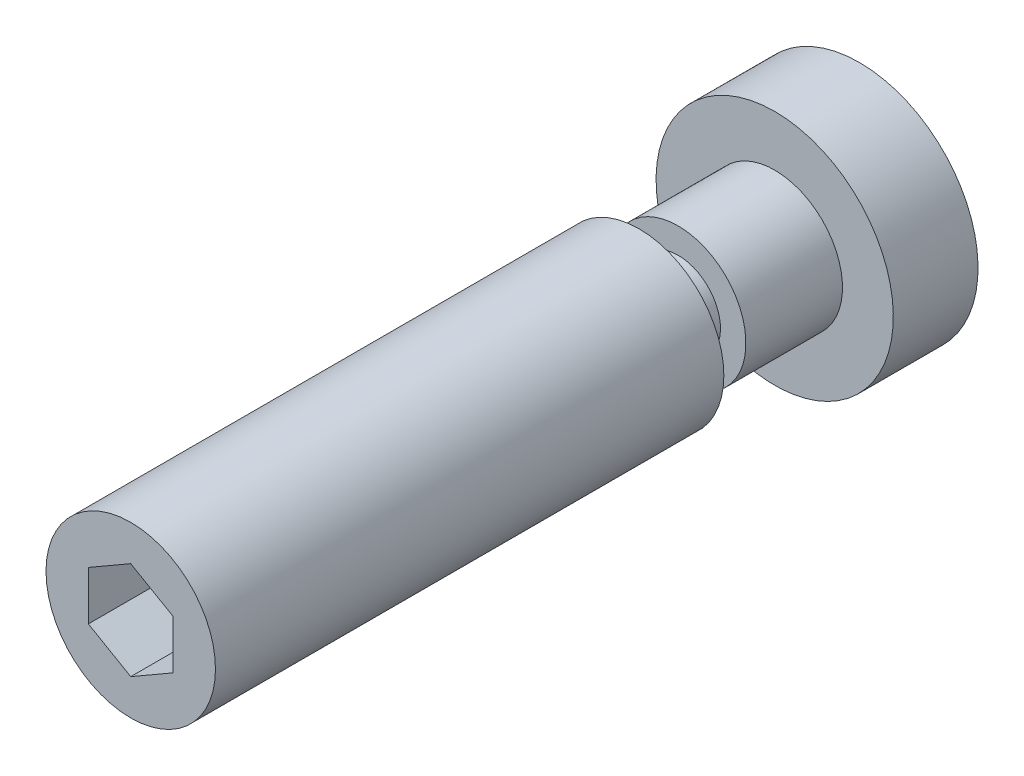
ISO-10303-21;
HEADER;
FILE_DESCRIPTION(('STEP AP214'),'2;1');
FILE_NAME('part.step','',(''),(''),'','','');
FILE_SCHEMA(('AUTOMOTIVE_DESIGN { 1 0 10303 214 1 1 1 1 }'));
ENDSEC;
DATA;
#1=APPLICATION_CONTEXT('core data for automotive mechanical design processes');
#2=APPLICATION_PROTOCOL_DEFINITION('international standard','automotive_design',2000,#1);
#3=PRODUCT_CONTEXT('',#1,'mechanical');
#4=PRODUCT('Part','Part','',(#3));
#5=PRODUCT_RELATED_PRODUCT_CATEGORY('part','',(#4));
#6=PRODUCT_DEFINITION_FORMATION('','',#4);
#7=PRODUCT_DEFINITION_CONTEXT('part definition',#1,'design');
#8=PRODUCT_DEFINITION('design','',#6,#7);
#9=PRODUCT_DEFINITION_SHAPE('','',#8);
#10=(LENGTH_UNIT() NAMED_UNIT(*) SI_UNIT(.MILLI.,.METRE.));
#11=(NAMED_UNIT(*) PLANE_ANGLE_UNIT() SI_UNIT($,.RADIAN.));
#12=(NAMED_UNIT(*) SI_UNIT($,.STERADIAN.) SOLID_ANGLE_UNIT());
#13=UNCERTAINTY_MEASURE_WITH_UNIT(LENGTH_MEASURE(1.E-05),#10,'distance_accuracy_value','');
#14=(GEOMETRIC_REPRESENTATION_CONTEXT(3) GLOBAL_UNCERTAINTY_ASSIGNED_CONTEXT((#13)) GLOBAL_UNIT_ASSIGNED_CONTEXT((#10,
#11,#12)) REPRESENTATION_CONTEXT('',''));
#15=CARTESIAN_POINT('',(0.,0.,0.));
#16=DIRECTION('',(0.,0.,1.));
#17=DIRECTION('',(1.,0.,0.));
#18=AXIS2_PLACEMENT_3D('',#15,#16,#17);
#19=CARTESIAN_POINT('',(7.084,-7.084,0.));
#20=DIRECTION('',(0.,0.,1.));
#21=DIRECTION('',(0.,1.,0.));
#22=AXIS2_PLACEMENT_3D('',#19,#20,#21);
#23=PLANE('',#22);
#24=CARTESIAN_POINT('',(0.,0.,0.));
#25=DIRECTION('',(0.,0.,1.));
#26=DIRECTION('',(0.,1.,0.));
#27=AXIS2_PLACEMENT_3D('',#24,#25,#26);
#28=CIRCLE('',#27,7.);
#29=CARTESIAN_POINT('',(0.,7.,0.));
#30=VERTEX_POINT('',#29);
#31=EDGE_CURVE('E18',#30,#30,#28,.F.);
#32=ORIENTED_EDGE('',*,*,#31,.T.);
#33=EDGE_LOOP('',(#32));
#34=FACE_BOUND('',#33,.T.);
#35=ADVANCED_FACE('F14',(#34),#23,.F.);
#36=CARTESIAN_POINT('',(0.,0.,0.));
#37=DIRECTION('',(0.,0.,1.));
#38=DIRECTION('',(0.,1.,0.));
#39=AXIS2_PLACEMENT_3D('',#36,#37,#38);
#40=CYLINDRICAL_SURFACE('',#39,7.);
#41=CARTESIAN_POINT('',(0.,0.,5.));
#42=DIRECTION('',(0.,0.,1.));
#43=DIRECTION('',(0.,1.,0.));
#44=AXIS2_PLACEMENT_3D('',#41,#42,#43);
#45=CIRCLE('',#44,7.);
#46=CARTESIAN_POINT('',(0.,7.,5.));
#47=VERTEX_POINT('',#46);
#48=EDGE_CURVE('E136',#47,#47,#45,.F.);
#49=ORIENTED_EDGE('',*,*,#48,.T.);
#50=EDGE_LOOP('',(#49));
#51=FACE_BOUND('',#50,.T.);
#52=ORIENTED_EDGE('',*,*,#31,.F.);
#53=EDGE_LOOP('',(#52));
#54=FACE_BOUND('',#53,.T.);
#55=ADVANCED_FACE('F144',(#51,#54),#40,.T.);
#56=CARTESIAN_POINT('',(7.084,7.084,5.));
#57=DIRECTION('',(0.,0.,-1.));
#58=DIRECTION('',(0.,-1.,0.));
#59=AXIS2_PLACEMENT_3D('',#56,#57,#58);
#60=PLANE('',#59);
#61=CARTESIAN_POINT('',(0.,0.,5.));
#62=DIRECTION('',(0.,0.,1.));
#63=DIRECTION('',(-1.,0.,0.));
#64=AXIS2_PLACEMENT_3D('',#61,#62,#63);
#65=CIRCLE('',#64,4.);
#66=CARTESIAN_POINT('',(-4.,0.,5.));
#67=VERTEX_POINT('',#66);
#68=EDGE_CURVE('E134',#67,#67,#65,.F.);
#69=ORIENTED_EDGE('',*,*,#68,.T.);
#70=EDGE_LOOP('',(#69));
#71=FACE_BOUND('',#70,.T.);
#72=ORIENTED_EDGE('',*,*,#48,.F.);
#73=EDGE_LOOP('',(#72));
#74=FACE_BOUND('',#73,.T.);
#75=ADVANCED_FACE('F146',(#71,#74),#60,.F.);
#76=CARTESIAN_POINT('',(0.,0.,5.));
#77=DIRECTION('',(0.,0.,1.));
#78=DIRECTION('',(-1.,0.,0.));
#79=AXIS2_PLACEMENT_3D('',#76,#77,#78);
#80=CYLINDRICAL_SURFACE('',#79,4.);
#81=CARTESIAN_POINT('',(0.,0.,10.7));
#82=DIRECTION('',(0.,0.,1.));
#83=DIRECTION('',(-1.,0.,0.));
#84=AXIS2_PLACEMENT_3D('',#81,#82,#83);
#85=CIRCLE('',#84,4.);
#86=CARTESIAN_POINT('',(-4.,0.,10.7));
#87=VERTEX_POINT('',#86);
#88=EDGE_CURVE('E131',#87,#87,#85,.F.);
#89=ORIENTED_EDGE('',*,*,#88,.T.);
#90=EDGE_LOOP('',(#89));
#91=FACE_BOUND('',#90,.T.);
#92=ORIENTED_EDGE('',*,*,#68,.F.);
#93=EDGE_LOOP('',(#92));
#94=FACE_BOUND('',#93,.T.);
#95=ADVANCED_FACE('F153',(#91,#94),#80,.T.);
#96=CARTESIAN_POINT('',(4.048,4.048,10.7));
#97=DIRECTION('',(0.,0.,-1.));
#98=DIRECTION('',(0.,-1.,0.));
#99=AXIS2_PLACEMENT_3D('',#96,#97,#98);
#100=PLANE('',#99);
#101=CARTESIAN_POINT('',(0.,0.,10.7));
#102=DIRECTION('',(0.,0.,1.));
#103=DIRECTION('',(0.,1.,0.));
#104=AXIS2_PLACEMENT_3D('',#101,#102,#103);
#105=CIRCLE('',#104,2.5);
#106=CARTESIAN_POINT('',(0.,2.5,10.7));
#107=VERTEX_POINT('',#106);
#108=EDGE_CURVE('E128',#107,#107,#105,.F.);
#109=ORIENTED_EDGE('',*,*,#108,.T.);
#110=EDGE_LOOP('',(#109));
#111=FACE_BOUND('',#110,.T.);
#112=ORIENTED_EDGE('',*,*,#88,.F.);
#113=EDGE_LOOP('',(#112));
#114=FACE_BOUND('',#113,.T.);
#115=ADVANCED_FACE('F177',(#111,#114),#100,.F.);
#116=CARTESIAN_POINT('',(0.,0.,10.7));
#117=DIRECTION('',(0.,0.,1.));
#118=DIRECTION('',(0.,1.,0.));
#119=AXIS2_PLACEMENT_3D('',#116,#117,#118);
#120=CYLINDRICAL_SURFACE('',#119,2.5);
#121=CARTESIAN_POINT('',(0.,0.,13.));
#122=DIRECTION('',(0.,0.,1.));
#123=DIRECTION('',(0.,1.,0.));
#124=AXIS2_PLACEMENT_3D('',#121,#122,#123);
#125=CIRCLE('',#124,2.5);
#126=CARTESIAN_POINT('',(0.,2.5,13.));
#127=VERTEX_POINT('',#126);
#128=EDGE_CURVE('E125',#127,#127,#125,.F.);
#129=ORIENTED_EDGE('',*,*,#128,.T.);
#130=EDGE_LOOP('',(#129));
#131=FACE_BOUND('',#130,.T.);
#132=ORIENTED_EDGE('',*,*,#108,.F.);
#133=EDGE_LOOP('',(#132));
#134=FACE_BOUND('',#133,.T.);
#135=ADVANCED_FACE('F175',(#131,#134),#120,.T.);
#136=CARTESIAN_POINT('',(5.06,5.06,43.));
#137=DIRECTION('',(0.,0.,-1.));
#138=DIRECTION('',(0.,-1.,0.));
#139=AXIS2_PLACEMENT_3D('',#136,#137,#138);
#140=PLANE('',#139);
#141=CARTESIAN_POINT('',(0.,0.,43.));
#142=DIRECTION('',(0.,0.,1.));
#143=DIRECTION('',(-1.,0.,0.));
#144=AXIS2_PLACEMENT_3D('',#141,#142,#143);
#145=CIRCLE('',#144,5.);
#146=CARTESIAN_POINT('',(-5.,0.,43.));
#147=VERTEX_POINT('',#146);
#148=EDGE_CURVE('E23',#147,#147,#145,.T.);
#149=ORIENTED_EDGE('',*,*,#148,.T.);
#150=EDGE_LOOP('',(#149));
#151=FACE_BOUND('',#150,.T.);
#152=DIRECTION('',(-0.866025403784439,-0.5,0.));
#153=VECTOR('',#152,1.);
#154=CARTESIAN_POINT('',(0.,2.88675134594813,43.));
#155=LINE('',#154,#153);
#156=CARTESIAN_POINT('',(0.,2.88675134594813,43.));
#157=VERTEX_POINT('',#156);
#158=CARTESIAN_POINT('',(-2.5,1.44337567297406,43.));
#159=VERTEX_POINT('',#158);
#160=EDGE_CURVE('E105',#157,#159,#155,.T.);
#161=ORIENTED_EDGE('',*,*,#160,.F.);
#162=DIRECTION('',(-0.866025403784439,0.5,0.));
#163=VECTOR('',#162,1.);
#164=CARTESIAN_POINT('',(2.5,1.44337567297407,43.));
#165=LINE('',#164,#163);
#166=CARTESIAN_POINT('',(2.5,1.44337567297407,43.));
#167=VERTEX_POINT('',#166);
#168=EDGE_CURVE('E31',#167,#157,#165,.T.);
#169=ORIENTED_EDGE('',*,*,#168,.F.);
#170=DIRECTION('',(0.,1.,0.));
#171=VECTOR('',#170,1.);
#172=CARTESIAN_POINT('',(2.5,-1.44337567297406,43.));
#173=LINE('',#172,#171);
#174=CARTESIAN_POINT('',(2.5,-1.44337567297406,43.));
#175=VERTEX_POINT('',#174);
#176=EDGE_CURVE('E114',#175,#167,#173,.T.);
#177=ORIENTED_EDGE('',*,*,#176,.F.);
#178=DIRECTION('',(0.866025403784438,0.5,0.));
#179=VECTOR('',#178,1.);
#180=CARTESIAN_POINT('',(0.,-2.88675134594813,43.));
#181=LINE('',#180,#179);
#182=CARTESIAN_POINT('',(0.,-2.88675134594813,43.));
#183=VERTEX_POINT('',#182);
#184=EDGE_CURVE('E112',#183,#175,#181,.T.);
#185=ORIENTED_EDGE('',*,*,#184,.F.);
#186=DIRECTION('',(0.866025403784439,-0.5,0.));
#187=VECTOR('',#186,1.);
#188=CARTESIAN_POINT('',(-2.5,-1.44337567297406,43.));
#189=LINE('',#188,#187);
#190=CARTESIAN_POINT('',(-2.5,-1.44337567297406,43.));
#191=VERTEX_POINT('',#190);
#192=EDGE_CURVE('E79',#191,#183,#189,.T.);
#193=ORIENTED_EDGE('',*,*,#192,.F.);
#194=DIRECTION('',(0.,-1.,0.));
#195=VECTOR('',#194,1.);
#196=CARTESIAN_POINT('',(-2.5,1.44337567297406,43.));
#197=LINE('',#196,#195);
#198=EDGE_CURVE('E108',#159,#191,#197,.T.);
#199=ORIENTED_EDGE('',*,*,#198,.F.);
#200=EDGE_LOOP('',(#161,#169,#177,#185,#193,#199));
#201=FACE_BOUND('',#200,.T.);
#202=ADVANCED_FACE('F169',(#151,#201),#140,.F.);
#203=CARTESIAN_POINT('',(5.06,-5.06,13.));
#204=DIRECTION('',(0.,0.,1.));
#205=DIRECTION('',(0.,1.,0.));
#206=AXIS2_PLACEMENT_3D('',#203,#204,#205);
#207=PLANE('',#206);
#208=ORIENTED_EDGE('',*,*,#128,.F.);
#209=EDGE_LOOP('',(#208));
#210=FACE_BOUND('',#209,.T.);
#211=CARTESIAN_POINT('',(0.,0.,13.));
#212=DIRECTION('',(0.,0.,1.));
#213=DIRECTION('',(-1.,0.,0.));
#214=AXIS2_PLACEMENT_3D('',#211,#212,#213);
#215=CIRCLE('',#214,5.);
#216=CARTESIAN_POINT('',(-5.,0.,13.));
#217=VERTEX_POINT('',#216);
#218=EDGE_CURVE('E9',#217,#217,#215,.F.);
#219=ORIENTED_EDGE('',*,*,#218,.T.);
#220=EDGE_LOOP('',(#219));
#221=FACE_BOUND('',#220,.T.);
#222=ADVANCED_FACE('F16',(#210,#221),#207,.F.);
#223=CARTESIAN_POINT('',(0.,0.,13.));
#224=DIRECTION('',(0.,0.,1.));
#225=DIRECTION('',(-1.,0.,0.));
#226=AXIS2_PLACEMENT_3D('',#223,#224,#225);
#227=CYLINDRICAL_SURFACE('',#226,5.);
#228=ORIENTED_EDGE('',*,*,#148,.F.);
#229=EDGE_LOOP('',(#228));
#230=FACE_BOUND('',#229,.T.);
#231=ORIENTED_EDGE('',*,*,#218,.F.);
#232=EDGE_LOOP('',(#231));
#233=FACE_BOUND('',#232,.T.);
#234=ADVANCED_FACE('F159',(#230,#233),#227,.T.);
#235=CARTESIAN_POINT('',(2.5,1.44337567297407,37.));
#236=DIRECTION('',(0.5,0.866025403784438,0.));
#237=DIRECTION('',(-0.866025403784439,0.5,0.));
#238=AXIS2_PLACEMENT_3D('',#235,#236,#237);
#239=PLANE('',#238);
#240=ORIENTED_EDGE('',*,*,#168,.T.);
#241=DIRECTION('',(0.,0.,1.));
#242=VECTOR('',#241,1.);
#243=CARTESIAN_POINT('',(0.,2.88675134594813,37.));
#244=LINE('',#243,#242);
#245=CARTESIAN_POINT('',(0.,2.88675134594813,37.));
#246=VERTEX_POINT('',#245);
#247=EDGE_CURVE('E61',#246,#157,#244,.T.);
#248=ORIENTED_EDGE('',*,*,#247,.F.);
#249=DIRECTION('',(-0.866025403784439,0.5,0.));
#250=VECTOR('',#249,1.);
#251=CARTESIAN_POINT('',(2.5,1.44337567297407,37.));
#252=LINE('',#251,#250);
#253=CARTESIAN_POINT('',(2.5,1.44337567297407,37.));
#254=VERTEX_POINT('',#253);
#255=EDGE_CURVE('E116',#254,#246,#252,.T.);
#256=ORIENTED_EDGE('',*,*,#255,.F.);
#257=DIRECTION('',(0.,0.,1.));
#258=VECTOR('',#257,1.);
#259=CARTESIAN_POINT('',(2.5,1.44337567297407,37.));
#260=LINE('',#259,#258);
#261=EDGE_CURVE('E39',#254,#167,#260,.T.);
#262=ORIENTED_EDGE('',*,*,#261,.T.);
#263=EDGE_LOOP('',(#240,#248,#256,#262));
#264=FACE_BOUND('',#263,.T.);
#265=ADVANCED_FACE('F157',(#264),#239,.F.);
#266=CARTESIAN_POINT('',(2.5,-1.44337567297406,37.));
#267=DIRECTION('',(1.,0.,0.));
#268=DIRECTION('',(0.,1.,0.));
#269=AXIS2_PLACEMENT_3D('',#266,#267,#268);
#270=PLANE('',#269);
#271=ORIENTED_EDGE('',*,*,#176,.T.);
#272=ORIENTED_EDGE('',*,*,#261,.F.);
#273=DIRECTION('',(0.,1.,0.));
#274=VECTOR('',#273,1.);
#275=CARTESIAN_POINT('',(2.5,-1.44337567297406,37.));
#276=LINE('',#275,#274);
#277=CARTESIAN_POINT('',(2.5,-1.44337567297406,37.));
#278=VERTEX_POINT('',#277);
#279=EDGE_CURVE('E91',#278,#254,#276,.T.);
#280=ORIENTED_EDGE('',*,*,#279,.F.);
#281=DIRECTION('',(0.,0.,1.));
#282=VECTOR('',#281,1.);
#283=CARTESIAN_POINT('',(2.5,-1.44337567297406,37.));
#284=LINE('',#283,#282);
#285=EDGE_CURVE('E83',#278,#175,#284,.T.);
#286=ORIENTED_EDGE('',*,*,#285,.T.);
#287=EDGE_LOOP('',(#271,#272,#280,#286));
#288=FACE_BOUND('',#287,.T.);
#289=ADVANCED_FACE('F167',(#288),#270,.F.);
#290=CARTESIAN_POINT('',(0.,-2.88675134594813,37.));
#291=DIRECTION('',(0.5,-0.866025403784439,0.));
#292=DIRECTION('',(0.866025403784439,0.5,0.));
#293=AXIS2_PLACEMENT_3D('',#290,#291,#292);
#294=PLANE('',#293);
#295=ORIENTED_EDGE('',*,*,#184,.T.);
#296=ORIENTED_EDGE('',*,*,#285,.F.);
#297=DIRECTION('',(0.866025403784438,0.5,0.));
#298=VECTOR('',#297,1.);
#299=CARTESIAN_POINT('',(0.,-2.88675134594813,37.));
#300=LINE('',#299,#298);
#301=CARTESIAN_POINT('',(0.,-2.88675134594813,37.));
#302=VERTEX_POINT('',#301);
#303=EDGE_CURVE('E87',#302,#278,#300,.T.);
#304=ORIENTED_EDGE('',*,*,#303,.F.);
#305=DIRECTION('',(0.,0.,1.));
#306=VECTOR('',#305,1.);
#307=CARTESIAN_POINT('',(0.,-2.88675134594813,37.));
#308=LINE('',#307,#306);
#309=EDGE_CURVE('E72',#302,#183,#308,.T.);
#310=ORIENTED_EDGE('',*,*,#309,.T.);
#311=EDGE_LOOP('',(#295,#296,#304,#310));
#312=FACE_BOUND('',#311,.T.);
#313=ADVANCED_FACE('F88',(#312),#294,.F.);
#314=CARTESIAN_POINT('',(-2.5,-1.44337567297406,37.));
#315=DIRECTION('',(-0.5,-0.866025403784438,0.));
#316=DIRECTION('',(0.866025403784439,-0.5,0.));
#317=AXIS2_PLACEMENT_3D('',#314,#315,#316);
#318=PLANE('',#317);
#319=ORIENTED_EDGE('',*,*,#192,.T.);
#320=ORIENTED_EDGE('',*,*,#309,.F.);
#321=DIRECTION('',(0.866025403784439,-0.5,0.));
#322=VECTOR('',#321,1.);
#323=CARTESIAN_POINT('',(-2.5,-1.44337567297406,37.));
#324=LINE('',#323,#322);
#325=CARTESIAN_POINT('',(-2.5,-1.44337567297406,37.));
#326=VERTEX_POINT('',#325);
#327=EDGE_CURVE('E76',#326,#302,#324,.T.);
#328=ORIENTED_EDGE('',*,*,#327,.F.);
#329=DIRECTION('',(0.,0.,1.));
#330=VECTOR('',#329,1.);
#331=CARTESIAN_POINT('',(-2.5,-1.44337567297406,37.));
#332=LINE('',#331,#330);
#333=EDGE_CURVE('E84',#326,#191,#332,.T.);
#334=ORIENTED_EDGE('',*,*,#333,.T.);
#335=EDGE_LOOP('',(#319,#320,#328,#334));
#336=FACE_BOUND('',#335,.T.);
#337=ADVANCED_FACE('F74',(#336),#318,.F.);
#338=CARTESIAN_POINT('',(-2.5,1.44337567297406,37.));
#339=DIRECTION('',(-1.,0.,0.));
#340=DIRECTION('',(0.,-1.,0.));
#341=AXIS2_PLACEMENT_3D('',#338,#339,#340);
#342=PLANE('',#341);
#343=ORIENTED_EDGE('',*,*,#198,.T.);
#344=ORIENTED_EDGE('',*,*,#333,.F.);
#345=DIRECTION('',(0.,-1.,0.));
#346=VECTOR('',#345,1.);
#347=CARTESIAN_POINT('',(-2.5,1.44337567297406,37.));
#348=LINE('',#347,#346);
#349=CARTESIAN_POINT('',(-2.5,1.44337567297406,37.));
#350=VERTEX_POINT('',#349);
#351=EDGE_CURVE('E97',#350,#326,#348,.T.);
#352=ORIENTED_EDGE('',*,*,#351,.F.);
#353=DIRECTION('',(0.,0.,1.));
#354=VECTOR('',#353,1.);
#355=CARTESIAN_POINT('',(-2.5,1.44337567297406,37.));
#356=LINE('',#355,#354);
#357=EDGE_CURVE('E120',#350,#159,#356,.T.);
#358=ORIENTED_EDGE('',*,*,#357,.T.);
#359=EDGE_LOOP('',(#343,#344,#352,#358));
#360=FACE_BOUND('',#359,.T.);
#361=ADVANCED_FACE('F214',(#360),#342,.F.);
#362=CARTESIAN_POINT('',(0.,2.88675134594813,37.));
#363=DIRECTION('',(-0.5,0.866025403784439,0.));
#364=DIRECTION('',(-0.866025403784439,-0.5,0.));
#365=AXIS2_PLACEMENT_3D('',#362,#363,#364);
#366=PLANE('',#365);
#367=ORIENTED_EDGE('',*,*,#160,.T.);
#368=ORIENTED_EDGE('',*,*,#357,.F.);
#369=DIRECTION('',(-0.866025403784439,-0.5,0.));
#370=VECTOR('',#369,1.);
#371=CARTESIAN_POINT('',(0.,2.88675134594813,37.));
#372=LINE('',#371,#370);
#373=EDGE_CURVE('E99',#246,#350,#372,.T.);
#374=ORIENTED_EDGE('',*,*,#373,.F.);
#375=ORIENTED_EDGE('',*,*,#247,.T.);
#376=EDGE_LOOP('',(#367,#368,#374,#375));
#377=FACE_BOUND('',#376,.T.);
#378=ADVANCED_FACE('F202',(#377),#366,.F.);
#379=CARTESIAN_POINT('',(0.,2.88675134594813,37.));
#380=DIRECTION('',(0.,0.,1.));
#381=DIRECTION('',(1.,0.,0.));
#382=AXIS2_PLACEMENT_3D('',#379,#380,#381);
#383=PLANE('',#382);
#384=ORIENTED_EDGE('',*,*,#255,.T.);
#385=ORIENTED_EDGE('',*,*,#373,.T.);
#386=ORIENTED_EDGE('',*,*,#351,.T.);
#387=ORIENTED_EDGE('',*,*,#327,.T.);
#388=ORIENTED_EDGE('',*,*,#303,.T.);
#389=ORIENTED_EDGE('',*,*,#279,.T.);
#390=EDGE_LOOP('',(#384,#385,#386,#387,#388,#389));
#391=FACE_BOUND('',#390,.T.);
#392=ADVANCED_FACE('F94',(#391),#383,.T.);
#393=CLOSED_SHELL('',(#35,#55,#75,#95,#115,#135,#202,#222,#234,#265,#289,#313,#337,#361,#378,#392));
#394=MANIFOLD_SOLID_BREP('B1',#393);
#395=ADVANCED_BREP_SHAPE_REPRESENTATION('',(#18,#394),#14);
#396=SHAPE_DEFINITION_REPRESENTATION(#9,#395);
ENDSEC;
END-ISO-10303-21;
